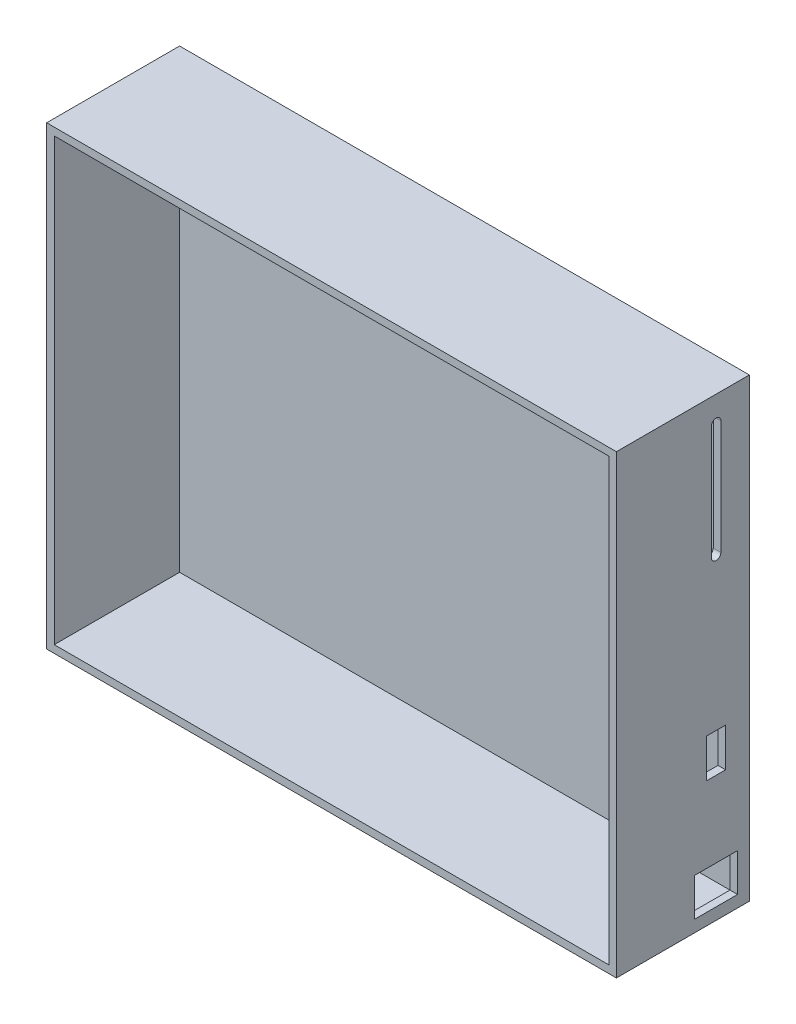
from build123d import *

# Parameters (mm, degrees)
SKETCH1_W           = 190.5
SKETCH1_H           = 152.4
BOSS_EXTRUDE1_DEPTH = 22.225
SHELL1_T            = -2.54
SKETCH3_W           = 6.35
SKETCH3_H           = 12.954
SKETCH3_W_2         = 14.351
SKETCH3_H_2         = 12.7
CUT_EXTRUDE1_DEPTH  = 2.54


with BuildPart() as part:
    # Sketch1 → Boss-Extrude1 (new, symmetric)
    with BuildSketch(Plane.XY):
        Rectangle(SKETCH1_W, SKETCH1_H)
    extrude(amount=BOSS_EXTRUDE1_DEPTH, both=True)

    # Shell1
    shell1_openings = [part.faces().sort_by_distance(p)[0] for p in [
        (0, 0, 22.225),
    ]]
    offset(amount=SHELL1_T, openings=shell1_openings, kind=Kind.INTERSECTION)

    # Sketch3 → Cut-Extrude1 (cut)
    with BuildSketch(Plane(origin=(95.25, 0, 0), x_dir=(0, 0, -1), z_dir=(1, 0, 0))):
        with BuildLine():
            Line((12.7, 67.691), (12.7, 29.591))
            ThreePointArc((12.7, 29.591), (11.1125, 28.0035), (9.525, 29.591))
            Line((9.525, 29.591), (9.525, 67.691))
            ThreePointArc((9.525, 67.691), (11.1125, 69.2785), (12.7, 67.691))
        make_face()
        with Locations((11.1125, -27.686)):
            Rectangle(SKETCH3_W, SKETCH3_H)
        with Locations((11.1125, -65.913)):
            Rectangle(SKETCH3_W_2, SKETCH3_H_2)
    extrude(amount=-CUT_EXTRUDE1_DEPTH, mode=Mode.SUBTRACT)


solid = part.part
